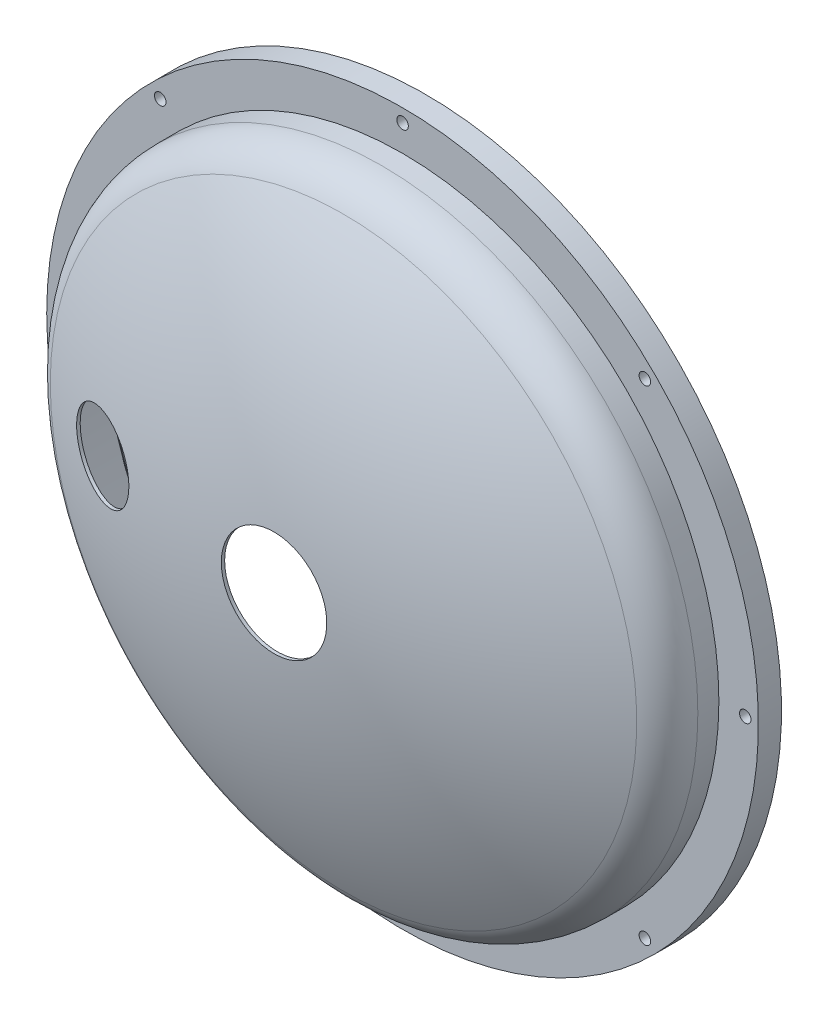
from build123d import *

# Parameters (mm, degrees)
F_7_8_0_875_DIAMETER_HOLE1_D = 22.225
CIRPATTERN1_COUNT            = 8
SKETCH4_R                    = 76.2
CUT_EXTRUDE1_DEPTH           = 1013.899644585


with BuildPart() as part:
    # Sketch1 → Revolve1 (revolve)
    with BuildSketch(Plane(origin=(0, 0, 0), x_dir=(1, 0, 0), z_dir=(0, 1, 0)), mode=Mode.PRIVATE) as revolve1_sk:
        with BuildLine():
            Line((603.25, 207.098971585), (603.25, 277.8125))
            Line((603.25, 277.8125), (609.6, 284.1625))
            Line((609.6, 284.1625), (609.6, 287.3375))
            Line((609.6, 287.3375), (642.9375, 287.3375))
            Line((642.9375, 287.3375), (642.9375, 292.1))
            Line((642.9375, 292.1), (685.8, 292.1))
            Line((685.8, 292.1), (685.8, 247.65))
            Line((685.8, 247.65), (609.6, 247.65))
            Line((609.6, 247.65), (609.6, 207.098971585))
            ThreePointArc((609.6, 207.098971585), (597.607583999, 164.248885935), (565.114722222, 133.848856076))
            ThreePointArc((565.114722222, 133.848856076), (340.008837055, 43.890558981), (101.6, 0))
            Line((101.6, 0), (101.6, 6.372048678))
            ThreePointArc((101.6, 6.372048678), (338.500883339, 50.064593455), (562.186666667, 139.483480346))
            ThreePointArc((562.186666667, 139.483480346), (592.180077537, 167.545046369), (603.25, 207.098971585))
        make_face()
    revolve(revolve1_sk.sketch.rotate(Axis((0, 0, -88.99), (0, 0, 1)), 180), axis=Axis((0, 0, -88.99), (0, 0, 1)))

    # 7_8 _0.875_ Diameter Hole1 (through all)
    with Locations(Plane.XY.offset(-247.65)):
        with Locations((660.4, 0)):
            f_7_8_0_875_diameter_hole1 = Hole(F_7_8_0_875_DIAMETER_HOLE1_D / 2)

    # CirPattern1: 7_8 _0.875_ Diameter Hole1 ×8 about axis
    cirpattern1_axis = Axis((0, 0, 0), (0, 0, 1))
    for i in range(1, CIRPATTERN1_COUNT):
        add(f_7_8_0_875_diameter_hole1.rotate(cirpattern1_axis, i * 360 / CIRPATTERN1_COUNT), mode=Mode.SUBTRACT)

    # Sketch4 → Cut-Extrude1 (cut, through all)
    with BuildSketch(Plane.XY):
        with Locations((-393.7, 0)):
            Circle(SKETCH4_R)
    extrude(amount=-CUT_EXTRUDE1_DEPTH, mode=Mode.SUBTRACT)


solid = part.part
